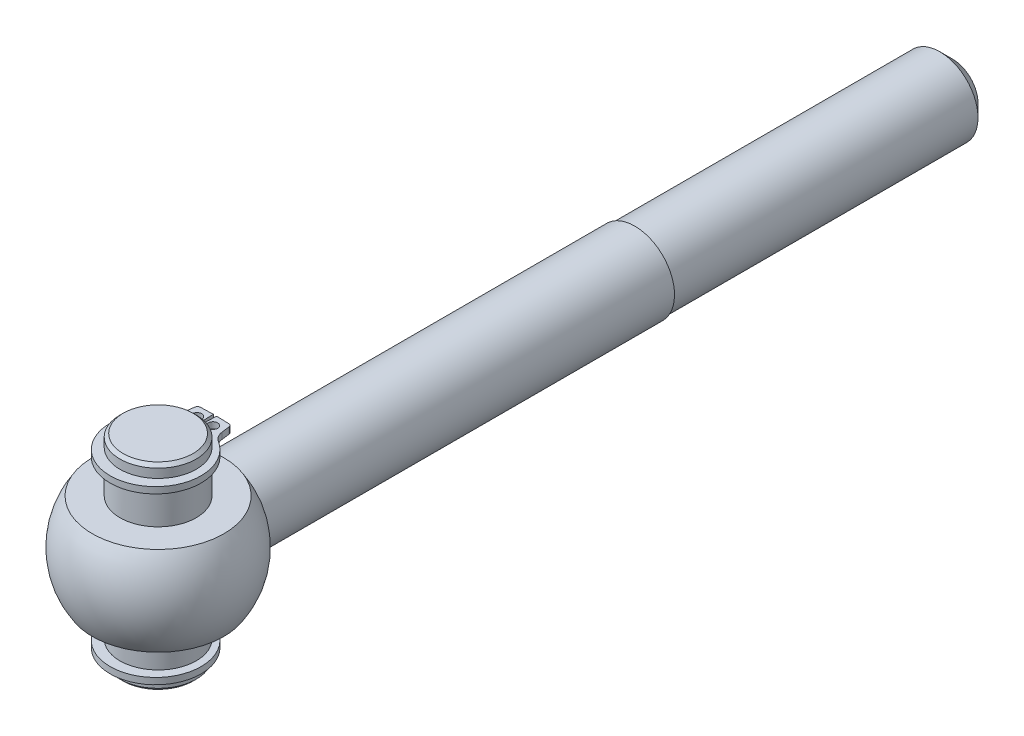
ISO-10303-21;
HEADER;
FILE_DESCRIPTION(('STEP AP214'),'2;1');
FILE_NAME('part.step','',(''),(''),'','','');
FILE_SCHEMA(('AUTOMOTIVE_DESIGN { 1 0 10303 214 1 1 1 1 }'));
ENDSEC;
DATA;
#1=APPLICATION_CONTEXT('core data for automotive mechanical design processes');
#2=APPLICATION_PROTOCOL_DEFINITION('international standard','automotive_design',2000,#1);
#3=PRODUCT_CONTEXT('',#1,'mechanical');
#4=PRODUCT('Part','Part','',(#3));
#5=PRODUCT_RELATED_PRODUCT_CATEGORY('part','',(#4));
#6=PRODUCT_DEFINITION_FORMATION('','',#4);
#7=PRODUCT_DEFINITION_CONTEXT('part definition',#1,'design');
#8=PRODUCT_DEFINITION('design','',#6,#7);
#9=PRODUCT_DEFINITION_SHAPE('','',#8);
#10=(LENGTH_UNIT() NAMED_UNIT(*) SI_UNIT(.MILLI.,.METRE.));
#11=(NAMED_UNIT(*) PLANE_ANGLE_UNIT() SI_UNIT($,.RADIAN.));
#12=(NAMED_UNIT(*) SI_UNIT($,.STERADIAN.) SOLID_ANGLE_UNIT());
#13=UNCERTAINTY_MEASURE_WITH_UNIT(LENGTH_MEASURE(1.E-05),#10,'distance_accuracy_value','');
#14=(GEOMETRIC_REPRESENTATION_CONTEXT(3) GLOBAL_UNCERTAINTY_ASSIGNED_CONTEXT((#13)) GLOBAL_UNIT_ASSIGNED_CONTEXT((#10,
#11,#12)) REPRESENTATION_CONTEXT('',''));
#15=CARTESIAN_POINT('',(0.,0.,0.));
#16=DIRECTION('',(0.,0.,1.));
#17=DIRECTION('',(1.,0.,0.));
#18=AXIS2_PLACEMENT_3D('',#15,#16,#17);
#19=CARTESIAN_POINT('',(-6.77014300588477E-13,13.4999999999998,125.));
#20=DIRECTION('',(0.,-1.,0.));
#21=DIRECTION('',(1.,0.,0.));
#22=AXIS2_PLACEMENT_3D('',#19,#20,#21);
#23=PLANE('',#22);
#24=CARTESIAN_POINT('',(-1.25000000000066,13.4999999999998,117.630256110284));
#25=DIRECTION('',(0.,-1.,0.));
#26=DIRECTION('',(1.,0.,0.));
#27=AXIS2_PLACEMENT_3D('',#24,#25,#26);
#28=CIRCLE('',#27,0.75);
#29=CARTESIAN_POINT('',(-0.500000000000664,13.4999999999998,117.630256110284));
#30=VERTEX_POINT('',#29);
#31=EDGE_CURVE('E644',#30,#30,#28,.T.);
#32=ORIENTED_EDGE('',*,*,#31,.T.);
#33=EDGE_LOOP('',(#32));
#34=FACE_BOUND('',#33,.T.);
#35=CARTESIAN_POINT('',(1.24999999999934,13.4999999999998,117.630256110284));
#36=DIRECTION('',(0.,-1.,0.));
#37=DIRECTION('',(1.,0.,0.));
#38=AXIS2_PLACEMENT_3D('',#35,#36,#37);
#39=CIRCLE('',#38,0.75);
#40=CARTESIAN_POINT('',(1.99999999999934,13.4999999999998,117.630256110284));
#41=VERTEX_POINT('',#40);
#42=EDGE_CURVE('E652',#41,#41,#39,.T.);
#43=ORIENTED_EDGE('',*,*,#42,.T.);
#44=EDGE_LOOP('',(#43));
#45=FACE_BOUND('',#44,.T.);
#46=CARTESIAN_POINT('',(-6.77014300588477E-13,13.4999999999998,125.));
#47=DIRECTION('',(0.,1.,0.));
#48=DIRECTION('',(1.,0.,0.));
#49=AXIS2_PLACEMENT_3D('',#46,#47,#48);
#50=CIRCLE('',#49,5.75);
#51=CARTESIAN_POINT('',(-0.160614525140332,13.4999999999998,119.252243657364));
#52=VERTEX_POINT('',#51);
#53=CARTESIAN_POINT('',(0.160614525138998,13.4999999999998,119.252243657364));
#54=VERTEX_POINT('',#53);
#55=EDGE_CURVE('E205',#52,#54,#50,.T.);
#56=ORIENTED_EDGE('',*,*,#55,.F.);
#57=DIRECTION('',(0.0279329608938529,0.,0.999609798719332));
#58=VECTOR('',#57,1.);
#59=CARTESIAN_POINT('',(-0.160614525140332,13.4999999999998,119.252243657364));
#60=LINE('',#59,#58);
#61=CARTESIAN_POINT('',(-0.250000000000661,13.4999999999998,116.053492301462));
#62=VERTEX_POINT('',#61);
#63=EDGE_CURVE('E207',#62,#52,#60,.T.);
#64=ORIENTED_EDGE('',*,*,#63,.F.);
#65=DIRECTION('',(0.999609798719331,0.,-0.0279329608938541));
#66=VECTOR('',#65,1.);
#67=CARTESIAN_POINT('',(-0.250000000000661,13.4999999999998,116.053492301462));
#68=LINE('',#67,#66);
#69=CARTESIAN_POINT('',(-2.21257169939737,13.4999999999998,116.108334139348));
#70=VERTEX_POINT('',#69);
#71=EDGE_CURVE('E218',#70,#62,#68,.T.);
#72=ORIENTED_EDGE('',*,*,#71,.F.);
#73=CARTESIAN_POINT('',(-2.19860521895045,13.4999999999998,116.608139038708));
#74=DIRECTION('',(0.,-1.,0.));
#75=DIRECTION('',(1.,0.,0.));
#76=AXIS2_PLACEMENT_3D('',#73,#74,#75);
#77=CIRCLE('',#76,0.5);
#78=CARTESIAN_POINT('',(-2.69432764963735,13.4999999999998,116.542875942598));
#79=VERTEX_POINT('',#78);
#80=EDGE_CURVE('E222',#79,#70,#77,.T.);
#81=ORIENTED_EDGE('',*,*,#80,.F.);
#82=DIRECTION('',(0.130526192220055,0.,-0.99144486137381));
#83=VECTOR('',#82,1.);
#84=CARTESIAN_POINT('',(-2.86377907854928,13.4999999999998,117.829987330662));
#85=LINE('',#84,#83);
#86=CARTESIAN_POINT('',(-2.86377907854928,13.4999999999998,117.829987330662));
#87=VERTEX_POINT('',#86);
#88=EDGE_CURVE('E676',#87,#79,#85,.T.);
#89=ORIENTED_EDGE('',*,*,#88,.F.);
#90=CARTESIAN_POINT('',(-4.96489683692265,13.4999999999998,117.553369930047));
#91=DIRECTION('',(0.,1.,0.));
#92=DIRECTION('',(1.,0.,0.));
#93=AXIS2_PLACEMENT_3D('',#90,#91,#92);
#94=CIRCLE('',#93,2.11924822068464);
#95=CARTESIAN_POINT('',(-3.83083698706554,13.4999999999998,119.343655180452));
#96=VERTEX_POINT('',#95);
#97=EDGE_CURVE('E673',#96,#87,#94,.T.);
#98=ORIENTED_EDGE('',*,*,#97,.F.);
#99=CARTESIAN_POINT('',(-6.77713708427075E-13,13.4999999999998,125.391211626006));
#100=DIRECTION('',(0.,-1.,0.));
#101=DIRECTION('',(1.,0.,0.));
#102=AXIS2_PLACEMENT_3D('',#99,#100,#101);
#103=CIRCLE('',#102,7.15878837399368);
#104=CARTESIAN_POINT('',(3.83083698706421,13.4999999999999,119.343655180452));
#105=VERTEX_POINT('',#104);
#106=EDGE_CURVE('E670',#105,#96,#103,.T.);
#107=ORIENTED_EDGE('',*,*,#106,.F.);
#108=CARTESIAN_POINT('',(4.96489683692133,13.4999999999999,117.553369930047));
#109=DIRECTION('',(0.,1.,0.));
#110=DIRECTION('',(1.,0.,0.));
#111=AXIS2_PLACEMENT_3D('',#108,#109,#110);
#112=CIRCLE('',#111,2.11924822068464);
#113=CARTESIAN_POINT('',(2.86377907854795,13.4999999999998,117.829987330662));
#114=VERTEX_POINT('',#113);
#115=EDGE_CURVE('E667',#114,#105,#112,.T.);
#116=ORIENTED_EDGE('',*,*,#115,.F.);
#117=DIRECTION('',(0.130526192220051,0.,0.99144486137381));
#118=VECTOR('',#117,1.);
#119=CARTESIAN_POINT('',(2.86377907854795,13.4999999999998,117.829987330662));
#120=LINE('',#119,#118);
#121=CARTESIAN_POINT('',(2.69432764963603,13.4999999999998,116.542875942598));
#122=VERTEX_POINT('',#121);
#123=EDGE_CURVE('E664',#122,#114,#120,.T.);
#124=ORIENTED_EDGE('',*,*,#123,.F.);
#125=CARTESIAN_POINT('',(2.19860521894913,13.4999999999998,116.608139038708));
#126=DIRECTION('',(0.,-1.,0.));
#127=DIRECTION('',(-1.,0.,0.));
#128=AXIS2_PLACEMENT_3D('',#125,#126,#127);
#129=CIRCLE('',#128,0.5);
#130=CARTESIAN_POINT('',(2.21257169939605,13.4999999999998,116.108334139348));
#131=VERTEX_POINT('',#130);
#132=EDGE_CURVE('E661',#131,#122,#129,.T.);
#133=ORIENTED_EDGE('',*,*,#132,.F.);
#134=DIRECTION('',(0.999609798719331,0.,0.0279329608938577));
#135=VECTOR('',#134,1.);
#136=CARTESIAN_POINT('',(0.249999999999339,13.4999999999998,116.053492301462));
#137=LINE('',#136,#135);
#138=CARTESIAN_POINT('',(0.249999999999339,13.4999999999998,116.053492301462));
#139=VERTEX_POINT('',#138);
#140=EDGE_CURVE('E658',#139,#131,#137,.T.);
#141=ORIENTED_EDGE('',*,*,#140,.F.);
#142=DIRECTION('',(0.0279329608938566,0.,-0.999609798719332));
#143=VECTOR('',#142,1.);
#144=CARTESIAN_POINT('',(0.160614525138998,13.4999999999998,119.252243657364));
#145=LINE('',#144,#143);
#146=EDGE_CURVE('E209',#54,#139,#145,.T.);
#147=ORIENTED_EDGE('',*,*,#146,.F.);
#148=EDGE_LOOP('',(#56,#64,#72,#81,#89,#98,#107,#116,#124,#133,#141,#147));
#149=FACE_BOUND('',#148,.T.);
#150=ADVANCED_FACE('F14',(#34,#45,#149),#23,.F.);
#151=CARTESIAN_POINT('',(1.24999999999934,13.4999999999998,117.630256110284));
#152=DIRECTION('',(0.,-1.,0.));
#153=DIRECTION('',(1.,0.,0.));
#154=AXIS2_PLACEMENT_3D('',#151,#152,#153);
#155=CYLINDRICAL_SURFACE('',#154,0.75);
#156=ORIENTED_EDGE('',*,*,#42,.F.);
#157=EDGE_LOOP('',(#156));
#158=FACE_BOUND('',#157,.T.);
#159=CARTESIAN_POINT('',(1.24999999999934,12.4999999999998,117.630256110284));
#160=DIRECTION('',(0.,-1.,0.));
#161=DIRECTION('',(1.,0.,0.));
#162=AXIS2_PLACEMENT_3D('',#159,#160,#161);
#163=CIRCLE('',#162,0.75);
#164=CARTESIAN_POINT('',(1.99999999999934,12.4999999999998,117.630256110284));
#165=VERTEX_POINT('',#164);
#166=EDGE_CURVE('E649',#165,#165,#163,.T.);
#167=ORIENTED_EDGE('',*,*,#166,.T.);
#168=EDGE_LOOP('',(#167));
#169=FACE_BOUND('',#168,.T.);
#170=ADVANCED_FACE('F631',(#158,#169),#155,.F.);
#171=CARTESIAN_POINT('',(-1.25000000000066,13.4999999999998,117.630256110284));
#172=DIRECTION('',(0.,-1.,0.));
#173=DIRECTION('',(1.,0.,0.));
#174=AXIS2_PLACEMENT_3D('',#171,#172,#173);
#175=CYLINDRICAL_SURFACE('',#174,0.75);
#176=ORIENTED_EDGE('',*,*,#31,.F.);
#177=EDGE_LOOP('',(#176));
#178=FACE_BOUND('',#177,.T.);
#179=CARTESIAN_POINT('',(-1.25000000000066,12.4999999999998,117.630256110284));
#180=DIRECTION('',(0.,-1.,0.));
#181=DIRECTION('',(1.,0.,0.));
#182=AXIS2_PLACEMENT_3D('',#179,#180,#181);
#183=CIRCLE('',#182,0.75);
#184=CARTESIAN_POINT('',(-0.500000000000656,12.4999999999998,117.630256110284));
#185=VERTEX_POINT('',#184);
#186=EDGE_CURVE('E384',#185,#185,#183,.T.);
#187=ORIENTED_EDGE('',*,*,#186,.T.);
#188=EDGE_LOOP('',(#187));
#189=FACE_BOUND('',#188,.T.);
#190=ADVANCED_FACE('F625',(#178,#189),#175,.F.);
#191=CARTESIAN_POINT('',(-0.160614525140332,13.4999999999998,119.252243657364));
#192=DIRECTION('',(0.999609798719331,0.,-0.0279329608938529));
#193=DIRECTION('',(0.0279329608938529,0.,0.999609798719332));
#194=AXIS2_PLACEMENT_3D('',#191,#192,#193);
#195=PLANE('',#194);
#196=DIRECTION('',(0.0279329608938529,0.,0.999609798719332));
#197=VECTOR('',#196,1.);
#198=CARTESIAN_POINT('',(-0.160614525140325,12.4999999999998,119.252243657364));
#199=LINE('',#198,#197);
#200=CARTESIAN_POINT('',(-0.250000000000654,12.4999999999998,116.053492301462));
#201=VERTEX_POINT('',#200);
#202=CARTESIAN_POINT('',(-0.167597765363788,12.4999999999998,119.002341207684));
#203=VERTEX_POINT('',#202);
#204=EDGE_CURVE('E210',#201,#203,#199,.T.);
#205=ORIENTED_EDGE('',*,*,#204,.F.);
#206=DIRECTION('',(0.,-1.,0.));
#207=VECTOR('',#206,1.);
#208=CARTESIAN_POINT('',(-0.250000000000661,13.4999999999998,116.053492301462));
#209=LINE('',#208,#207);
#210=EDGE_CURVE('E199',#62,#201,#209,.T.);
#211=ORIENTED_EDGE('',*,*,#210,.F.);
#212=ORIENTED_EDGE('',*,*,#63,.T.);
#213=DIRECTION('',(0.,-1.,0.));
#214=VECTOR('',#213,1.);
#215=CARTESIAN_POINT('',(-0.160614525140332,13.4999999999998,119.252243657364));
#216=LINE('',#215,#214);
#217=CARTESIAN_POINT('',(-0.160614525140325,12.4999999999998,119.252243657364));
#218=VERTEX_POINT('',#217);
#219=EDGE_CURVE('E24',#52,#218,#216,.T.);
#220=ORIENTED_EDGE('',*,*,#219,.T.);
#221=EDGE_CURVE('E33',#203,#218,#199,.T.);
#222=ORIENTED_EDGE('',*,*,#221,.F.);
#223=EDGE_LOOP('',(#205,#211,#212,#220,#222));
#224=FACE_BOUND('',#223,.T.);
#225=ADVANCED_FACE('F217',(#224),#195,.T.);
#226=CARTESIAN_POINT('',(-0.250000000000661,13.4999999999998,116.053492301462));
#227=DIRECTION('',(-0.0279329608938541,0.,-0.999609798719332));
#228=DIRECTION('',(0.999609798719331,0.,-0.0279329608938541));
#229=AXIS2_PLACEMENT_3D('',#226,#227,#228);
#230=PLANE('',#229);
#231=DIRECTION('',(0.999609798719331,0.,-0.0279329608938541));
#232=VECTOR('',#231,1.);
#233=CARTESIAN_POINT('',(-0.250000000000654,12.4999999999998,116.053492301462));
#234=LINE('',#233,#232);
#235=CARTESIAN_POINT('',(-2.21257169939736,12.4999999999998,116.108334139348));
#236=VERTEX_POINT('',#235);
#237=EDGE_CURVE('E254',#236,#201,#234,.T.);
#238=ORIENTED_EDGE('',*,*,#237,.F.);
#239=DIRECTION('',(0.,-1.,0.));
#240=VECTOR('',#239,1.);
#241=CARTESIAN_POINT('',(-2.21257169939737,13.4999999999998,116.108334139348));
#242=LINE('',#241,#240);
#243=EDGE_CURVE('E260',#70,#236,#242,.T.);
#244=ORIENTED_EDGE('',*,*,#243,.F.);
#245=ORIENTED_EDGE('',*,*,#71,.T.);
#246=ORIENTED_EDGE('',*,*,#210,.T.);
#247=EDGE_LOOP('',(#238,#244,#245,#246));
#248=FACE_BOUND('',#247,.T.);
#249=ADVANCED_FACE('F618',(#248),#230,.T.);
#250=CARTESIAN_POINT('',(-2.19860521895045,13.4999999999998,116.608139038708));
#251=DIRECTION('',(0.,-1.,0.));
#252=DIRECTION('',(1.,0.,0.));
#253=AXIS2_PLACEMENT_3D('',#250,#251,#252);
#254=CYLINDRICAL_SURFACE('',#253,0.5);
#255=CARTESIAN_POINT('',(-2.19860521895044,12.4999999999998,116.608139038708));
#256=DIRECTION('',(0.,-1.,0.));
#257=DIRECTION('',(1.,0.,0.));
#258=AXIS2_PLACEMENT_3D('',#255,#256,#257);
#259=CIRCLE('',#258,0.5);
#260=CARTESIAN_POINT('',(-2.69432764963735,12.4999999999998,116.542875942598));
#261=VERTEX_POINT('',#260);
#262=EDGE_CURVE('E251',#261,#236,#259,.T.);
#263=ORIENTED_EDGE('',*,*,#262,.F.);
#264=DIRECTION('',(0.,-1.,0.));
#265=VECTOR('',#264,1.);
#266=CARTESIAN_POINT('',(-2.69432764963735,13.4999999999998,116.542875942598));
#267=LINE('',#266,#265);
#268=EDGE_CURVE('E262',#79,#261,#267,.T.);
#269=ORIENTED_EDGE('',*,*,#268,.F.);
#270=ORIENTED_EDGE('',*,*,#80,.T.);
#271=ORIENTED_EDGE('',*,*,#243,.T.);
#272=EDGE_LOOP('',(#263,#269,#270,#271));
#273=FACE_BOUND('',#272,.T.);
#274=ADVANCED_FACE('F614',(#273),#254,.T.);
#275=CARTESIAN_POINT('',(-2.86377907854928,13.4999999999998,117.829987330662));
#276=DIRECTION('',(-0.99144486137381,0.,-0.130526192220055));
#277=DIRECTION('',(0.130526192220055,0.,-0.99144486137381));
#278=AXIS2_PLACEMENT_3D('',#275,#276,#277);
#279=PLANE('',#278);
#280=DIRECTION('',(0.130526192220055,0.,-0.99144486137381));
#281=VECTOR('',#280,1.);
#282=CARTESIAN_POINT('',(-2.86377907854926,12.4999999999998,117.829987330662));
#283=LINE('',#282,#281);
#284=CARTESIAN_POINT('',(-2.86377907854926,12.4999999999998,117.829987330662));
#285=VERTEX_POINT('',#284);
#286=EDGE_CURVE('E248',#285,#261,#283,.T.);
#287=ORIENTED_EDGE('',*,*,#286,.F.);
#288=DIRECTION('',(0.,-1.,0.));
#289=VECTOR('',#288,1.);
#290=CARTESIAN_POINT('',(-2.86377907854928,13.4999999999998,117.829987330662));
#291=LINE('',#290,#289);
#292=EDGE_CURVE('E264',#87,#285,#291,.T.);
#293=ORIENTED_EDGE('',*,*,#292,.F.);
#294=ORIENTED_EDGE('',*,*,#88,.T.);
#295=ORIENTED_EDGE('',*,*,#268,.T.);
#296=EDGE_LOOP('',(#287,#293,#294,#295));
#297=FACE_BOUND('',#296,.T.);
#298=ADVANCED_FACE('F610',(#297),#279,.T.);
#299=CARTESIAN_POINT('',(-4.96489683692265,13.4999999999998,117.553369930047));
#300=DIRECTION('',(0.,-1.,0.));
#301=DIRECTION('',(1.,0.,0.));
#302=AXIS2_PLACEMENT_3D('',#299,#300,#301);
#303=CYLINDRICAL_SURFACE('',#302,2.11924822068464);
#304=CARTESIAN_POINT('',(-4.96489683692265,12.4999999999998,117.553369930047));
#305=DIRECTION('',(0.,1.,0.));
#306=DIRECTION('',(1.,0.,0.));
#307=AXIS2_PLACEMENT_3D('',#304,#305,#306);
#308=CIRCLE('',#307,2.11924822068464);
#309=CARTESIAN_POINT('',(-3.83083698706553,12.4999999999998,119.343655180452));
#310=VERTEX_POINT('',#309);
#311=EDGE_CURVE('E245',#310,#285,#308,.T.);
#312=ORIENTED_EDGE('',*,*,#311,.F.);
#313=DIRECTION('',(0.,-1.,0.));
#314=VECTOR('',#313,1.);
#315=CARTESIAN_POINT('',(-3.83083698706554,13.4999999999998,119.343655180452));
#316=LINE('',#315,#314);
#317=EDGE_CURVE('E266',#96,#310,#316,.T.);
#318=ORIENTED_EDGE('',*,*,#317,.F.);
#319=ORIENTED_EDGE('',*,*,#97,.T.);
#320=ORIENTED_EDGE('',*,*,#292,.T.);
#321=EDGE_LOOP('',(#312,#318,#319,#320));
#322=FACE_BOUND('',#321,.T.);
#323=ADVANCED_FACE('F606',(#322),#303,.F.);
#324=CARTESIAN_POINT('',(-6.77713708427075E-13,13.4999999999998,125.391211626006));
#325=DIRECTION('',(0.,-1.,0.));
#326=DIRECTION('',(1.,0.,0.));
#327=AXIS2_PLACEMENT_3D('',#324,#325,#326);
#328=CYLINDRICAL_SURFACE('',#327,7.15878837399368);
#329=CARTESIAN_POINT('',(-6.70730741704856E-13,12.4999999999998,125.391211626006));
#330=DIRECTION('',(0.,-1.,0.));
#331=DIRECTION('',(1.,0.,0.));
#332=AXIS2_PLACEMENT_3D('',#329,#330,#331);
#333=CIRCLE('',#332,7.15878837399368);
#334=CARTESIAN_POINT('',(3.83083698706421,12.4999999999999,119.343655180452));
#335=VERTEX_POINT('',#334);
#336=EDGE_CURVE('E242',#335,#310,#333,.T.);
#337=ORIENTED_EDGE('',*,*,#336,.F.);
#338=DIRECTION('',(0.,-1.,0.));
#339=VECTOR('',#338,1.);
#340=CARTESIAN_POINT('',(3.83083698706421,13.4999999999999,119.343655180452));
#341=LINE('',#340,#339);
#342=EDGE_CURVE('E268',#105,#335,#341,.T.);
#343=ORIENTED_EDGE('',*,*,#342,.F.);
#344=ORIENTED_EDGE('',*,*,#106,.T.);
#345=ORIENTED_EDGE('',*,*,#317,.T.);
#346=EDGE_LOOP('',(#337,#343,#344,#345));
#347=FACE_BOUND('',#346,.T.);
#348=ADVANCED_FACE('F602',(#347),#328,.T.);
#349=CARTESIAN_POINT('',(4.96489683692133,13.4999999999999,117.553369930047));
#350=DIRECTION('',(0.,-1.,0.));
#351=DIRECTION('',(1.,0.,0.));
#352=AXIS2_PLACEMENT_3D('',#349,#350,#351);
#353=CYLINDRICAL_SURFACE('',#352,2.11924822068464);
#354=CARTESIAN_POINT('',(4.96489683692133,12.4999999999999,117.553369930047));
#355=DIRECTION('',(0.,1.,0.));
#356=DIRECTION('',(1.,0.,0.));
#357=AXIS2_PLACEMENT_3D('',#354,#355,#356);
#358=CIRCLE('',#357,2.11924822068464);
#359=CARTESIAN_POINT('',(2.86377907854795,12.4999999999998,117.829987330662));
#360=VERTEX_POINT('',#359);
#361=EDGE_CURVE('E239',#360,#335,#358,.T.);
#362=ORIENTED_EDGE('',*,*,#361,.F.);
#363=DIRECTION('',(0.,-1.,0.));
#364=VECTOR('',#363,1.);
#365=CARTESIAN_POINT('',(2.86377907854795,13.4999999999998,117.829987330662));
#366=LINE('',#365,#364);
#367=EDGE_CURVE('E270',#114,#360,#366,.T.);
#368=ORIENTED_EDGE('',*,*,#367,.F.);
#369=ORIENTED_EDGE('',*,*,#115,.T.);
#370=ORIENTED_EDGE('',*,*,#342,.T.);
#371=EDGE_LOOP('',(#362,#368,#369,#370));
#372=FACE_BOUND('',#371,.T.);
#373=ADVANCED_FACE('F598',(#372),#353,.F.);
#374=CARTESIAN_POINT('',(2.86377907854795,13.4999999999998,117.829987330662));
#375=DIRECTION('',(0.99144486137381,0.,-0.130526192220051));
#376=DIRECTION('',(0.130526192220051,0.,0.99144486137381));
#377=AXIS2_PLACEMENT_3D('',#374,#375,#376);
#378=PLANE('',#377);
#379=DIRECTION('',(0.130526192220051,0.,0.99144486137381));
#380=VECTOR('',#379,1.);
#381=CARTESIAN_POINT('',(2.86377907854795,12.4999999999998,117.829987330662));
#382=LINE('',#381,#380);
#383=CARTESIAN_POINT('',(2.69432764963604,12.4999999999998,116.542875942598));
#384=VERTEX_POINT('',#383);
#385=EDGE_CURVE('E236',#384,#360,#382,.T.);
#386=ORIENTED_EDGE('',*,*,#385,.F.);
#387=DIRECTION('',(0.,-1.,0.));
#388=VECTOR('',#387,1.);
#389=CARTESIAN_POINT('',(2.69432764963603,13.4999999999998,116.542875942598));
#390=LINE('',#389,#388);
#391=EDGE_CURVE('E272',#122,#384,#390,.T.);
#392=ORIENTED_EDGE('',*,*,#391,.F.);
#393=ORIENTED_EDGE('',*,*,#123,.T.);
#394=ORIENTED_EDGE('',*,*,#367,.T.);
#395=EDGE_LOOP('',(#386,#392,#393,#394));
#396=FACE_BOUND('',#395,.T.);
#397=ADVANCED_FACE('F594',(#396),#378,.T.);
#398=CARTESIAN_POINT('',(2.19860521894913,13.4999999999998,116.608139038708));
#399=DIRECTION('',(0.,-1.,0.));
#400=DIRECTION('',(1.,0.,0.));
#401=AXIS2_PLACEMENT_3D('',#398,#399,#400);
#402=CYLINDRICAL_SURFACE('',#401,0.5);
#403=CARTESIAN_POINT('',(2.19860521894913,12.4999999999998,116.608139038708));
#404=DIRECTION('',(0.,-1.,0.));
#405=DIRECTION('',(-1.,0.,0.));
#406=AXIS2_PLACEMENT_3D('',#403,#404,#405);
#407=CIRCLE('',#406,0.5);
#408=CARTESIAN_POINT('',(2.21257169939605,12.4999999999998,116.108334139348));
#409=VERTEX_POINT('',#408);
#410=EDGE_CURVE('E233',#409,#384,#407,.T.);
#411=ORIENTED_EDGE('',*,*,#410,.F.);
#412=DIRECTION('',(0.,-1.,0.));
#413=VECTOR('',#412,1.);
#414=CARTESIAN_POINT('',(2.21257169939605,13.4999999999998,116.108334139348));
#415=LINE('',#414,#413);
#416=EDGE_CURVE('E274',#131,#409,#415,.T.);
#417=ORIENTED_EDGE('',*,*,#416,.F.);
#418=ORIENTED_EDGE('',*,*,#132,.T.);
#419=ORIENTED_EDGE('',*,*,#391,.T.);
#420=EDGE_LOOP('',(#411,#417,#418,#419));
#421=FACE_BOUND('',#420,.T.);
#422=ADVANCED_FACE('F590',(#421),#402,.T.);
#423=CARTESIAN_POINT('',(0.249999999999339,13.4999999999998,116.053492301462));
#424=DIRECTION('',(0.0279329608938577,0.,-0.999609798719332));
#425=DIRECTION('',(0.999609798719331,0.,0.0279329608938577));
#426=AXIS2_PLACEMENT_3D('',#423,#424,#425);
#427=PLANE('',#426);
#428=DIRECTION('',(0.999609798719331,0.,0.0279329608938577));
#429=VECTOR('',#428,1.);
#430=CARTESIAN_POINT('',(0.249999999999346,12.4999999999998,116.053492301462));
#431=LINE('',#430,#429);
#432=CARTESIAN_POINT('',(0.249999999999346,12.4999999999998,116.053492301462));
#433=VERTEX_POINT('',#432);
#434=EDGE_CURVE('E229',#433,#409,#431,.T.);
#435=ORIENTED_EDGE('',*,*,#434,.F.);
#436=DIRECTION('',(0.,-1.,0.));
#437=VECTOR('',#436,1.);
#438=CARTESIAN_POINT('',(0.249999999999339,13.4999999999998,116.053492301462));
#439=LINE('',#438,#437);
#440=EDGE_CURVE('E220',#139,#433,#439,.T.);
#441=ORIENTED_EDGE('',*,*,#440,.F.);
#442=ORIENTED_EDGE('',*,*,#140,.T.);
#443=ORIENTED_EDGE('',*,*,#416,.T.);
#444=EDGE_LOOP('',(#435,#441,#442,#443));
#445=FACE_BOUND('',#444,.T.);
#446=ADVANCED_FACE('F587',(#445),#427,.T.);
#447=CARTESIAN_POINT('',(0.160614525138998,13.4999999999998,119.252243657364));
#448=DIRECTION('',(-0.999609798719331,0.,-0.0279329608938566));
#449=DIRECTION('',(0.0279329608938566,0.,-0.999609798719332));
#450=AXIS2_PLACEMENT_3D('',#447,#448,#449);
#451=PLANE('',#450);
#452=DIRECTION('',(0.0279329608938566,0.,-0.999609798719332));
#453=VECTOR('',#452,1.);
#454=CARTESIAN_POINT('',(0.160614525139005,12.4999999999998,119.252243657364));
#455=LINE('',#454,#453);
#456=CARTESIAN_POINT('',(0.160614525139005,12.4999999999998,119.252243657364));
#457=VERTEX_POINT('',#456);
#458=CARTESIAN_POINT('',(0.16759776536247,12.4999999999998,119.002341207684));
#459=VERTEX_POINT('',#458);
#460=EDGE_CURVE('E226',#457,#459,#455,.T.);
#461=ORIENTED_EDGE('',*,*,#460,.F.);
#462=DIRECTION('',(0.,-1.,0.));
#463=VECTOR('',#462,1.);
#464=CARTESIAN_POINT('',(0.160614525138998,13.4999999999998,119.252243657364));
#465=LINE('',#464,#463);
#466=EDGE_CURVE('E130',#54,#457,#465,.T.);
#467=ORIENTED_EDGE('',*,*,#466,.F.);
#468=ORIENTED_EDGE('',*,*,#146,.T.);
#469=ORIENTED_EDGE('',*,*,#440,.T.);
#470=EDGE_CURVE('E230',#459,#433,#455,.T.);
#471=ORIENTED_EDGE('',*,*,#470,.F.);
#472=EDGE_LOOP('',(#461,#467,#468,#469,#471));
#473=FACE_BOUND('',#472,.T.);
#474=ADVANCED_FACE('F584',(#473),#451,.T.);
#475=CARTESIAN_POINT('',(-6.70031333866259E-13,12.4999999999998,125.));
#476=DIRECTION('',(0.,-1.,0.));
#477=DIRECTION('',(1.,0.,0.));
#478=AXIS2_PLACEMENT_3D('',#475,#476,#477);
#479=PLANE('',#478);
#480=CARTESIAN_POINT('',(0.,12.4999999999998,125.));
#481=DIRECTION('',(0.,-1.,0.));
#482=DIRECTION('',(-1.,0.,0.));
#483=AXIS2_PLACEMENT_3D('',#480,#481,#482);
#484=CIRCLE('',#483,6.);
#485=EDGE_CURVE('E9',#459,#203,#484,.T.);
#486=ORIENTED_EDGE('',*,*,#485,.F.);
#487=ORIENTED_EDGE('',*,*,#470,.T.);
#488=ORIENTED_EDGE('',*,*,#434,.T.);
#489=ORIENTED_EDGE('',*,*,#410,.T.);
#490=ORIENTED_EDGE('',*,*,#385,.T.);
#491=ORIENTED_EDGE('',*,*,#361,.T.);
#492=ORIENTED_EDGE('',*,*,#336,.T.);
#493=ORIENTED_EDGE('',*,*,#311,.T.);
#494=ORIENTED_EDGE('',*,*,#286,.T.);
#495=ORIENTED_EDGE('',*,*,#262,.T.);
#496=ORIENTED_EDGE('',*,*,#237,.T.);
#497=ORIENTED_EDGE('',*,*,#204,.T.);
#498=EDGE_LOOP('',(#486,#487,#488,#489,#490,#491,#492,#493,#494,#495,#496,#497));
#499=FACE_BOUND('',#498,.T.);
#500=ORIENTED_EDGE('',*,*,#186,.F.);
#501=EDGE_LOOP('',(#500));
#502=FACE_BOUND('',#501,.T.);
#503=ORIENTED_EDGE('',*,*,#166,.F.);
#504=EDGE_LOOP('',(#503));
#505=FACE_BOUND('',#504,.T.);
#506=ADVANCED_FACE('F517',(#499,#502,#505),#479,.T.);
#507=CARTESIAN_POINT('',(0.,-15.5,125.));
#508=DIRECTION('',(0.,-1.,0.));
#509=DIRECTION('',(0.,0.,-1.));
#510=AXIS2_PLACEMENT_3D('',#507,#508,#509);
#511=PLANE('',#510);
#512=CARTESIAN_POINT('',(0.,-15.5,125.));
#513=DIRECTION('',(0.,-1.,0.));
#514=DIRECTION('',(0.,0.,-1.));
#515=AXIS2_PLACEMENT_3D('',#512,#513,#514);
#516=CIRCLE('',#515,5.5);
#517=CARTESIAN_POINT('',(0.,-15.5,119.5));
#518=VERTEX_POINT('',#517);
#519=EDGE_CURVE('E414',#518,#518,#516,.T.);
#520=ORIENTED_EDGE('',*,*,#519,.T.);
#521=EDGE_LOOP('',(#520));
#522=FACE_BOUND('',#521,.T.);
#523=ADVANCED_FACE('F514',(#522),#511,.T.);
#524=CARTESIAN_POINT('',(0.,-15.5,125.));
#525=DIRECTION('',(0.,1.,0.));
#526=DIRECTION('',(0.,0.,1.));
#527=AXIS2_PLACEMENT_3D('',#524,#525,#526);
#528=CONICAL_SURFACE('',#527,5.5,0.785398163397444);
#529=CARTESIAN_POINT('',(0.,-15.,125.));
#530=DIRECTION('',(0.,-1.,0.));
#531=DIRECTION('',(0.,0.,-1.));
#532=AXIS2_PLACEMENT_3D('',#529,#530,#531);
#533=CIRCLE('',#532,6.);
#534=CARTESIAN_POINT('',(0.,-15.,119.));
#535=VERTEX_POINT('',#534);
#536=EDGE_CURVE('E417',#535,#535,#533,.F.);
#537=ORIENTED_EDGE('',*,*,#536,.F.);
#538=EDGE_LOOP('',(#537));
#539=FACE_BOUND('',#538,.T.);
#540=ORIENTED_EDGE('',*,*,#519,.F.);
#541=EDGE_LOOP('',(#540));
#542=FACE_BOUND('',#541,.T.);
#543=ADVANCED_FACE('F495',(#539,#542),#528,.T.);
#544=CARTESIAN_POINT('',(0.,15.5,125.));
#545=DIRECTION('',(0.,-1.,0.));
#546=DIRECTION('',(0.,0.,-1.));
#547=AXIS2_PLACEMENT_3D('',#544,#545,#546);
#548=CYLINDRICAL_SURFACE('',#547,6.);
#549=ORIENTED_EDGE('',*,*,#536,.T.);
#550=EDGE_LOOP('',(#549));
#551=FACE_BOUND('',#550,.T.);
#552=CARTESIAN_POINT('',(0.,-13.6000000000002,125.));
#553=DIRECTION('',(0.,-1.,0.));
#554=DIRECTION('',(0.,0.,-1.));
#555=AXIS2_PLACEMENT_3D('',#552,#553,#554);
#556=CIRCLE('',#555,6.);
#557=CARTESIAN_POINT('',(0.,-13.6000000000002,119.));
#558=VERTEX_POINT('',#557);
#559=EDGE_CURVE('E403',#558,#558,#556,.T.);
#560=ORIENTED_EDGE('',*,*,#559,.T.);
#561=EDGE_LOOP('',(#560));
#562=FACE_BOUND('',#561,.T.);
#563=ADVANCED_FACE('F485',(#551,#562),#548,.T.);
#564=CARTESIAN_POINT('',(-4.,0.,0.));
#565=DIRECTION('',(0.,0.,-1.));
#566=DIRECTION('',(0.,-1.,0.));
#567=AXIS2_PLACEMENT_3D('',#564,#565,#566);
#568=PLANE('',#567);
#569=CARTESIAN_POINT('',(0.,0.,0.));
#570=DIRECTION('',(0.,0.,1.));
#571=DIRECTION('',(0.,1.,0.));
#572=AXIS2_PLACEMENT_3D('',#569,#570,#571);
#573=CIRCLE('',#572,4.);
#574=CARTESIAN_POINT('',(0.,4.,0.));
#575=VERTEX_POINT('',#574);
#576=EDGE_CURVE('E433',#575,#575,#573,.T.);
#577=ORIENTED_EDGE('',*,*,#576,.F.);
#578=EDGE_LOOP('',(#577));
#579=FACE_BOUND('',#578,.T.);
#580=ADVANCED_FACE('F494',(#579),#568,.T.);
#581=CARTESIAN_POINT('',(0.,-13.6000000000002,125.));
#582=DIRECTION('',(0.,-1.,0.));
#583=DIRECTION('',(0.,0.,-1.));
#584=AXIS2_PLACEMENT_3D('',#581,#582,#583);
#585=PLANE('',#584);
#586=ORIENTED_EDGE('',*,*,#559,.F.);
#587=EDGE_LOOP('',(#586));
#588=FACE_BOUND('',#587,.T.);
#589=CARTESIAN_POINT('',(0.,-13.6000000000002,125.));
#590=DIRECTION('',(0.,-1.,0.));
#591=DIRECTION('',(0.,0.,-1.));
#592=AXIS2_PLACEMENT_3D('',#589,#590,#591);
#593=CIRCLE('',#592,5.75);
#594=CARTESIAN_POINT('',(0.,-13.6000000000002,119.25));
#595=VERTEX_POINT('',#594);
#596=EDGE_CURVE('E397',#595,#595,#593,.T.);
#597=ORIENTED_EDGE('',*,*,#596,.T.);
#598=EDGE_LOOP('',(#597));
#599=FACE_BOUND('',#598,.T.);
#600=ADVANCED_FACE('F497',(#588,#599),#585,.F.);
#601=CARTESIAN_POINT('',(0.,-13.5000000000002,125.));
#602=DIRECTION('',(0.,1.,0.));
#603=DIRECTION('',(-1.,0.,0.));
#604=AXIS2_PLACEMENT_3D('',#601,#602,#603);
#605=PLANE('',#604);
#606=CARTESIAN_POINT('',(1.24999999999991,-13.5000000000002,117.630256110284));
#607=DIRECTION('',(0.,1.,0.));
#608=DIRECTION('',(-1.,0.,0.));
#609=AXIS2_PLACEMENT_3D('',#606,#607,#608);
#610=CIRCLE('',#609,0.75);
#611=CARTESIAN_POINT('',(0.499999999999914,-13.5000000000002,117.630256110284));
#612=VERTEX_POINT('',#611);
#613=EDGE_CURVE('E278',#612,#612,#610,.T.);
#614=ORIENTED_EDGE('',*,*,#613,.T.);
#615=EDGE_LOOP('',(#614));
#616=FACE_BOUND('',#615,.T.);
#617=CARTESIAN_POINT('',(-1.25000000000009,-13.5000000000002,117.630256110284));
#618=DIRECTION('',(0.,1.,0.));
#619=DIRECTION('',(-1.,0.,0.));
#620=AXIS2_PLACEMENT_3D('',#617,#618,#619);
#621=CIRCLE('',#620,0.75);
#622=CARTESIAN_POINT('',(-2.00000000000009,-13.5000000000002,117.630256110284));
#623=VERTEX_POINT('',#622);
#624=EDGE_CURVE('E285',#623,#623,#621,.T.);
#625=ORIENTED_EDGE('',*,*,#624,.T.);
#626=EDGE_LOOP('',(#625));
#627=FACE_BOUND('',#626,.T.);
#628=CARTESIAN_POINT('',(0.,-13.5000000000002,125.));
#629=DIRECTION('',(0.,-1.,0.));
#630=DIRECTION('',(-1.,0.,0.));
#631=AXIS2_PLACEMENT_3D('',#628,#629,#630);
#632=CIRCLE('',#631,5.75);
#633=CARTESIAN_POINT('',(0.160614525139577,-13.5000000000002,119.252243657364));
#634=VERTEX_POINT('',#633);
#635=CARTESIAN_POINT('',(-0.160614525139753,-13.5000000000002,119.252243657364));
#636=VERTEX_POINT('',#635);
#637=EDGE_CURVE('E291',#634,#636,#632,.T.);
#638=ORIENTED_EDGE('',*,*,#637,.F.);
#639=DIRECTION('',(-0.0279329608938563,0.,0.999609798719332));
#640=VECTOR('',#639,1.);
#641=CARTESIAN_POINT('',(0.160614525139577,-13.5000000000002,119.252243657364));
#642=LINE('',#641,#640);
#643=CARTESIAN_POINT('',(0.249999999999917,-13.5000000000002,116.053492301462));
#644=VERTEX_POINT('',#643);
#645=EDGE_CURVE('E325',#644,#634,#642,.T.);
#646=ORIENTED_EDGE('',*,*,#645,.F.);
#647=DIRECTION('',(-0.999609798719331,0.,-0.0279329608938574));
#648=VECTOR('',#647,1.);
#649=CARTESIAN_POINT('',(0.249999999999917,-13.5000000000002,116.053492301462));
#650=LINE('',#649,#648);
#651=CARTESIAN_POINT('',(2.21257169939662,-13.5000000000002,116.108334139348));
#652=VERTEX_POINT('',#651);
#653=EDGE_CURVE('E322',#652,#644,#650,.T.);
#654=ORIENTED_EDGE('',*,*,#653,.F.);
#655=CARTESIAN_POINT('',(2.1986052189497,-13.5000000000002,116.608139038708));
#656=DIRECTION('',(0.,1.,0.));
#657=DIRECTION('',(-1.,0.,0.));
#658=AXIS2_PLACEMENT_3D('',#655,#656,#657);
#659=CIRCLE('',#658,0.5);
#660=CARTESIAN_POINT('',(2.6943276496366,-13.5000000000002,116.542875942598));
#661=VERTEX_POINT('',#660);
#662=EDGE_CURVE('E319',#661,#652,#659,.T.);
#663=ORIENTED_EDGE('',*,*,#662,.F.);
#664=DIRECTION('',(-0.130526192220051,0.,-0.99144486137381));
#665=VECTOR('',#664,1.);
#666=CARTESIAN_POINT('',(2.86377907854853,-13.5000000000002,117.829987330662));
#667=LINE('',#666,#665);
#668=CARTESIAN_POINT('',(2.86377907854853,-13.5000000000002,117.829987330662));
#669=VERTEX_POINT('',#668);
#670=EDGE_CURVE('E316',#669,#661,#667,.T.);
#671=ORIENTED_EDGE('',*,*,#670,.F.);
#672=CARTESIAN_POINT('',(4.9648968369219,-13.5000000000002,117.553369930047));
#673=DIRECTION('',(0.,-1.,0.));
#674=DIRECTION('',(-1.,0.,0.));
#675=AXIS2_PLACEMENT_3D('',#672,#673,#674);
#676=CIRCLE('',#675,2.11924822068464);
#677=CARTESIAN_POINT('',(3.83083698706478,-13.5000000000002,119.343655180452));
#678=VERTEX_POINT('',#677);
#679=EDGE_CURVE('E313',#678,#669,#676,.T.);
#680=ORIENTED_EDGE('',*,*,#679,.F.);
#681=CARTESIAN_POINT('',(0.,-13.5000000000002,125.391211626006));
#682=DIRECTION('',(0.,1.,0.));
#683=DIRECTION('',(-1.,0.,0.));
#684=AXIS2_PLACEMENT_3D('',#681,#682,#683);
#685=CIRCLE('',#684,7.15878837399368);
#686=CARTESIAN_POINT('',(-3.83083698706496,-13.5000000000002,119.343655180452));
#687=VERTEX_POINT('',#686);
#688=EDGE_CURVE('E310',#687,#678,#685,.T.);
#689=ORIENTED_EDGE('',*,*,#688,.F.);
#690=CARTESIAN_POINT('',(-4.96489683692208,-13.5000000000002,117.553369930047));
#691=DIRECTION('',(0.,-1.,0.));
#692=DIRECTION('',(-1.,0.,0.));
#693=AXIS2_PLACEMENT_3D('',#690,#691,#692);
#694=CIRCLE('',#693,2.11924822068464);
#695=CARTESIAN_POINT('',(-2.8637790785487,-13.5000000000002,117.829987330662));
#696=VERTEX_POINT('',#695);
#697=EDGE_CURVE('E307',#696,#687,#694,.T.);
#698=ORIENTED_EDGE('',*,*,#697,.F.);
#699=DIRECTION('',(-0.130526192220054,0.,0.99144486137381));
#700=VECTOR('',#699,1.);
#701=CARTESIAN_POINT('',(-2.8637790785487,-13.5000000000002,117.829987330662));
#702=LINE('',#701,#700);
#703=CARTESIAN_POINT('',(-2.69432764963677,-13.5000000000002,116.542875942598));
#704=VERTEX_POINT('',#703);
#705=EDGE_CURVE('E304',#704,#696,#702,.T.);
#706=ORIENTED_EDGE('',*,*,#705,.F.);
#707=CARTESIAN_POINT('',(-2.19860521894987,-13.5000000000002,116.608139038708));
#708=DIRECTION('',(0.,1.,0.));
#709=DIRECTION('',(1.,0.,0.));
#710=AXIS2_PLACEMENT_3D('',#707,#708,#709);
#711=CIRCLE('',#710,0.5);
#712=CARTESIAN_POINT('',(-2.21257169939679,-13.5000000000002,116.108334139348));
#713=VERTEX_POINT('',#712);
#714=EDGE_CURVE('E301',#713,#704,#711,.T.);
#715=ORIENTED_EDGE('',*,*,#714,.F.);
#716=DIRECTION('',(-0.999609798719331,0.,0.0279329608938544));
#717=VECTOR('',#716,1.);
#718=CARTESIAN_POINT('',(-0.250000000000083,-13.5000000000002,116.053492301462));
#719=LINE('',#718,#717);
#720=CARTESIAN_POINT('',(-0.250000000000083,-13.5000000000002,116.053492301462));
#721=VERTEX_POINT('',#720);
#722=EDGE_CURVE('E298',#721,#713,#719,.T.);
#723=ORIENTED_EDGE('',*,*,#722,.F.);
#724=DIRECTION('',(-0.0279329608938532,0.,-0.999609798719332));
#725=VECTOR('',#724,1.);
#726=CARTESIAN_POINT('',(-0.160614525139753,-13.5000000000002,119.252243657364));
#727=LINE('',#726,#725);
#728=EDGE_CURVE('E294',#636,#721,#727,.T.);
#729=ORIENTED_EDGE('',*,*,#728,.F.);
#730=EDGE_LOOP('',(#638,#646,#654,#663,#671,#680,#689,#698,#706,#715,#723,#729));
#731=FACE_BOUND('',#730,.T.);
#732=ADVANCED_FACE('F503',(#616,#627,#731),#605,.F.);
#733=CARTESIAN_POINT('',(0.,0.,0.));
#734=DIRECTION('',(0.,0.,1.));
#735=DIRECTION('',(0.,1.,0.));
#736=AXIS2_PLACEMENT_3D('',#733,#734,#735);
#737=CONICAL_SURFACE('',#736,4.,0.785398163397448);
#738=CARTESIAN_POINT('',(0.,0.,2.));
#739=DIRECTION('',(0.,0.,1.));
#740=DIRECTION('',(0.,1.,0.));
#741=AXIS2_PLACEMENT_3D('',#738,#739,#740);
#742=CIRCLE('',#741,6.);
#743=CARTESIAN_POINT('',(0.,6.,2.));
#744=VERTEX_POINT('',#743);
#745=EDGE_CURVE('E390',#744,#744,#742,.T.);
#746=ORIENTED_EDGE('',*,*,#745,.F.);
#747=EDGE_LOOP('',(#746));
#748=FACE_BOUND('',#747,.T.);
#749=ORIENTED_EDGE('',*,*,#576,.T.);
#750=EDGE_LOOP('',(#749));
#751=FACE_BOUND('',#750,.T.);
#752=ADVANCED_FACE('F529',(#748,#751),#737,.T.);
#753=CARTESIAN_POINT('',(0.,-13.6000000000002,125.));
#754=DIRECTION('',(0.,1.,0.));
#755=DIRECTION('',(0.,0.,1.));
#756=AXIS2_PLACEMENT_3D('',#753,#754,#755);
#757=CYLINDRICAL_SURFACE('',#756,5.75);
#758=DIRECTION('',(0.,1.,0.));
#759=VECTOR('',#758,1.);
#760=CARTESIAN_POINT('',(0.160614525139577,-13.5000000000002,119.252243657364));
#761=LINE('',#760,#759);
#762=CARTESIAN_POINT('',(0.160614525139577,-12.5000000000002,119.252243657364));
#763=VERTEX_POINT('',#762);
#764=EDGE_CURVE('E359',#634,#763,#761,.T.);
#765=ORIENTED_EDGE('',*,*,#764,.F.);
#766=ORIENTED_EDGE('',*,*,#637,.T.);
#767=DIRECTION('',(0.,1.,0.));
#768=VECTOR('',#767,1.);
#769=CARTESIAN_POINT('',(-0.160614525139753,-13.5000000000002,119.252243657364));
#770=LINE('',#769,#768);
#771=CARTESIAN_POINT('',(-0.160614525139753,-12.5000000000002,119.252243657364));
#772=VERTEX_POINT('',#771);
#773=EDGE_CURVE('E328',#636,#772,#770,.T.);
#774=ORIENTED_EDGE('',*,*,#773,.T.);
#775=CARTESIAN_POINT('',(0.,-12.5000000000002,125.));
#776=DIRECTION('',(0.,-1.,0.));
#777=DIRECTION('',(0.,0.,-1.));
#778=AXIS2_PLACEMENT_3D('',#775,#776,#777);
#779=CIRCLE('',#778,5.75);
#780=EDGE_CURVE('E394',#772,#763,#779,.T.);
#781=ORIENTED_EDGE('',*,*,#780,.T.);
#782=EDGE_LOOP('',(#765,#766,#774,#781));
#783=FACE_BOUND('',#782,.T.);
#784=ORIENTED_EDGE('',*,*,#596,.F.);
#785=EDGE_LOOP('',(#784));
#786=FACE_BOUND('',#785,.T.);
#787=ADVANCED_FACE('F523',(#783,#786),#757,.T.);
#788=CARTESIAN_POINT('',(-1.25000000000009,-13.5000000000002,117.630256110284));
#789=DIRECTION('',(0.,1.,0.));
#790=DIRECTION('',(-1.,0.,0.));
#791=AXIS2_PLACEMENT_3D('',#788,#789,#790);
#792=CYLINDRICAL_SURFACE('',#791,0.75);
#793=ORIENTED_EDGE('',*,*,#624,.F.);
#794=EDGE_LOOP('',(#793));
#795=FACE_BOUND('',#794,.T.);
#796=CARTESIAN_POINT('',(-1.25000000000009,-12.5000000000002,117.630256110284));
#797=DIRECTION('',(0.,1.,0.));
#798=DIRECTION('',(-1.,0.,0.));
#799=AXIS2_PLACEMENT_3D('',#796,#797,#798);
#800=CIRCLE('',#799,0.75);
#801=CARTESIAN_POINT('',(-2.00000000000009,-12.5000000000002,117.630256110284));
#802=VERTEX_POINT('',#801);
#803=EDGE_CURVE('E281',#802,#802,#800,.T.);
#804=ORIENTED_EDGE('',*,*,#803,.T.);
#805=EDGE_LOOP('',(#804));
#806=FACE_BOUND('',#805,.T.);
#807=ADVANCED_FACE('F528',(#795,#806),#792,.F.);
#808=CARTESIAN_POINT('',(1.24999999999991,-13.5000000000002,117.630256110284));
#809=DIRECTION('',(0.,1.,0.));
#810=DIRECTION('',(-1.,0.,0.));
#811=AXIS2_PLACEMENT_3D('',#808,#809,#810);
#812=CYLINDRICAL_SURFACE('',#811,0.75);
#813=ORIENTED_EDGE('',*,*,#613,.F.);
#814=EDGE_LOOP('',(#813));
#815=FACE_BOUND('',#814,.T.);
#816=CARTESIAN_POINT('',(1.24999999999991,-12.5000000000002,117.630256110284));
#817=DIRECTION('',(0.,1.,0.));
#818=DIRECTION('',(-1.,0.,0.));
#819=AXIS2_PLACEMENT_3D('',#816,#817,#818);
#820=CIRCLE('',#819,0.75);
#821=CARTESIAN_POINT('',(0.499999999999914,-12.5000000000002,117.630256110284));
#822=VERTEX_POINT('',#821);
#823=EDGE_CURVE('E282',#822,#822,#820,.T.);
#824=ORIENTED_EDGE('',*,*,#823,.T.);
#825=EDGE_LOOP('',(#824));
#826=FACE_BOUND('',#825,.T.);
#827=ADVANCED_FACE('F573',(#815,#826),#812,.F.);
#828=CARTESIAN_POINT('',(0.160614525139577,-13.5000000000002,119.252243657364));
#829=DIRECTION('',(-0.999609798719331,0.,-0.0279329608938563));
#830=DIRECTION('',(-0.0279329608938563,0.,0.999609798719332));
#831=AXIS2_PLACEMENT_3D('',#828,#829,#830);
#832=PLANE('',#831);
#833=DIRECTION('',(-0.0279329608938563,0.,0.999609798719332));
#834=VECTOR('',#833,1.);
#835=CARTESIAN_POINT('',(0.160614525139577,-12.5000000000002,119.252243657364));
#836=LINE('',#835,#834);
#837=CARTESIAN_POINT('',(0.249999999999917,-12.5000000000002,116.053492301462));
#838=VERTEX_POINT('',#837);
#839=CARTESIAN_POINT('',(0.167597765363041,-12.5000000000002,119.002341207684));
#840=VERTEX_POINT('',#839);
#841=EDGE_CURVE('E295',#838,#840,#836,.T.);
#842=ORIENTED_EDGE('',*,*,#841,.F.);
#843=DIRECTION('',(0.,1.,0.));
#844=VECTOR('',#843,1.);
#845=CARTESIAN_POINT('',(0.249999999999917,-13.5000000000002,116.053492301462));
#846=LINE('',#845,#844);
#847=EDGE_CURVE('E361',#644,#838,#846,.T.);
#848=ORIENTED_EDGE('',*,*,#847,.F.);
#849=ORIENTED_EDGE('',*,*,#645,.T.);
#850=ORIENTED_EDGE('',*,*,#764,.T.);
#851=EDGE_CURVE('E122',#840,#763,#836,.T.);
#852=ORIENTED_EDGE('',*,*,#851,.F.);
#853=EDGE_LOOP('',(#842,#848,#849,#850,#852));
#854=FACE_BOUND('',#853,.T.);
#855=ADVANCED_FACE('F570',(#854),#832,.T.);
#856=CARTESIAN_POINT('',(0.249999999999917,-13.5000000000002,116.053492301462));
#857=DIRECTION('',(0.0279329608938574,0.,-0.999609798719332));
#858=DIRECTION('',(-0.999609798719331,0.,-0.0279329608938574));
#859=AXIS2_PLACEMENT_3D('',#856,#857,#858);
#860=PLANE('',#859);
#861=DIRECTION('',(-0.999609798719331,0.,-0.0279329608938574));
#862=VECTOR('',#861,1.);
#863=CARTESIAN_POINT('',(0.249999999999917,-12.5000000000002,116.053492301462));
#864=LINE('',#863,#862);
#865=CARTESIAN_POINT('',(2.21257169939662,-12.5000000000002,116.108334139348));
#866=VERTEX_POINT('',#865);
#867=EDGE_CURVE('E355',#866,#838,#864,.T.);
#868=ORIENTED_EDGE('',*,*,#867,.F.);
#869=DIRECTION('',(0.,1.,0.));
#870=VECTOR('',#869,1.);
#871=CARTESIAN_POINT('',(2.21257169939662,-13.5000000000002,116.108334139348));
#872=LINE('',#871,#870);
#873=EDGE_CURVE('E363',#652,#866,#872,.T.);
#874=ORIENTED_EDGE('',*,*,#873,.F.);
#875=ORIENTED_EDGE('',*,*,#653,.T.);
#876=ORIENTED_EDGE('',*,*,#847,.T.);
#877=EDGE_LOOP('',(#868,#874,#875,#876));
#878=FACE_BOUND('',#877,.T.);
#879=ADVANCED_FACE('F566',(#878),#860,.T.);
#880=CARTESIAN_POINT('',(2.1986052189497,-13.5000000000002,116.608139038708));
#881=DIRECTION('',(0.,1.,0.));
#882=DIRECTION('',(-1.,0.,0.));
#883=AXIS2_PLACEMENT_3D('',#880,#881,#882);
#884=CYLINDRICAL_SURFACE('',#883,0.5);
#885=CARTESIAN_POINT('',(2.1986052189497,-12.5000000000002,116.608139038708));
#886=DIRECTION('',(0.,1.,0.));
#887=DIRECTION('',(-1.,0.,0.));
#888=AXIS2_PLACEMENT_3D('',#885,#886,#887);
#889=CIRCLE('',#888,0.5);
#890=CARTESIAN_POINT('',(2.6943276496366,-12.5000000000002,116.542875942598));
#891=VERTEX_POINT('',#890);
#892=EDGE_CURVE('E352',#891,#866,#889,.T.);
#893=ORIENTED_EDGE('',*,*,#892,.F.);
#894=DIRECTION('',(0.,1.,0.));
#895=VECTOR('',#894,1.);
#896=CARTESIAN_POINT('',(2.6943276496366,-13.5000000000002,116.542875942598));
#897=LINE('',#896,#895);
#898=EDGE_CURVE('E365',#661,#891,#897,.T.);
#899=ORIENTED_EDGE('',*,*,#898,.F.);
#900=ORIENTED_EDGE('',*,*,#662,.T.);
#901=ORIENTED_EDGE('',*,*,#873,.T.);
#902=EDGE_LOOP('',(#893,#899,#900,#901));
#903=FACE_BOUND('',#902,.T.);
#904=ADVANCED_FACE('F562',(#903),#884,.T.);
#905=CARTESIAN_POINT('',(2.86377907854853,-13.5000000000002,117.829987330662));
#906=DIRECTION('',(0.99144486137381,0.,-0.130526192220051));
#907=DIRECTION('',(-0.130526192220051,0.,-0.99144486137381));
#908=AXIS2_PLACEMENT_3D('',#905,#906,#907);
#909=PLANE('',#908);
#910=DIRECTION('',(-0.130526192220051,0.,-0.99144486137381));
#911=VECTOR('',#910,1.);
#912=CARTESIAN_POINT('',(2.86377907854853,-12.5000000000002,117.829987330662));
#913=LINE('',#912,#911);
#914=CARTESIAN_POINT('',(2.86377907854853,-12.5000000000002,117.829987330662));
#915=VERTEX_POINT('',#914);
#916=EDGE_CURVE('E349',#915,#891,#913,.T.);
#917=ORIENTED_EDGE('',*,*,#916,.F.);
#918=DIRECTION('',(0.,1.,0.));
#919=VECTOR('',#918,1.);
#920=CARTESIAN_POINT('',(2.86377907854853,-13.5000000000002,117.829987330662));
#921=LINE('',#920,#919);
#922=EDGE_CURVE('E367',#669,#915,#921,.T.);
#923=ORIENTED_EDGE('',*,*,#922,.F.);
#924=ORIENTED_EDGE('',*,*,#670,.T.);
#925=ORIENTED_EDGE('',*,*,#898,.T.);
#926=EDGE_LOOP('',(#917,#923,#924,#925));
#927=FACE_BOUND('',#926,.T.);
#928=ADVANCED_FACE('F558',(#927),#909,.T.);
#929=CARTESIAN_POINT('',(4.9648968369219,-13.5000000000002,117.553369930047));
#930=DIRECTION('',(0.,1.,0.));
#931=DIRECTION('',(-1.,0.,0.));
#932=AXIS2_PLACEMENT_3D('',#929,#930,#931);
#933=CYLINDRICAL_SURFACE('',#932,2.11924822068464);
#934=CARTESIAN_POINT('',(4.9648968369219,-12.5000000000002,117.553369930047));
#935=DIRECTION('',(0.,-1.,0.));
#936=DIRECTION('',(-1.,0.,0.));
#937=AXIS2_PLACEMENT_3D('',#934,#935,#936);
#938=CIRCLE('',#937,2.11924822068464);
#939=CARTESIAN_POINT('',(3.83083698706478,-12.5000000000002,119.343655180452));
#940=VERTEX_POINT('',#939);
#941=EDGE_CURVE('E346',#940,#915,#938,.T.);
#942=ORIENTED_EDGE('',*,*,#941,.F.);
#943=DIRECTION('',(0.,1.,0.));
#944=VECTOR('',#943,1.);
#945=CARTESIAN_POINT('',(3.83083698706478,-13.5000000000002,119.343655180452));
#946=LINE('',#945,#944);
#947=EDGE_CURVE('E369',#678,#940,#946,.T.);
#948=ORIENTED_EDGE('',*,*,#947,.F.);
#949=ORIENTED_EDGE('',*,*,#679,.T.);
#950=ORIENTED_EDGE('',*,*,#922,.T.);
#951=EDGE_LOOP('',(#942,#948,#949,#950));
#952=FACE_BOUND('',#951,.T.);
#953=ADVANCED_FACE('F554',(#952),#933,.F.);
#954=CARTESIAN_POINT('',(0.,-13.5000000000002,125.391211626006));
#955=DIRECTION('',(0.,1.,0.));
#956=DIRECTION('',(-1.,0.,0.));
#957=AXIS2_PLACEMENT_3D('',#954,#955,#956);
#958=CYLINDRICAL_SURFACE('',#957,7.15878837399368);
#959=CARTESIAN_POINT('',(0.,-12.5000000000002,125.391211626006));
#960=DIRECTION('',(0.,1.,0.));
#961=DIRECTION('',(-1.,0.,0.));
#962=AXIS2_PLACEMENT_3D('',#959,#960,#961);
#963=CIRCLE('',#962,7.15878837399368);
#964=CARTESIAN_POINT('',(-3.83083698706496,-12.5000000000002,119.343655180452));
#965=VERTEX_POINT('',#964);
#966=EDGE_CURVE('E343',#965,#940,#963,.T.);
#967=ORIENTED_EDGE('',*,*,#966,.F.);
#968=DIRECTION('',(0.,1.,0.));
#969=VECTOR('',#968,1.);
#970=CARTESIAN_POINT('',(-3.83083698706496,-13.5000000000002,119.343655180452));
#971=LINE('',#970,#969);
#972=EDGE_CURVE('E371',#687,#965,#971,.T.);
#973=ORIENTED_EDGE('',*,*,#972,.F.);
#974=ORIENTED_EDGE('',*,*,#688,.T.);
#975=ORIENTED_EDGE('',*,*,#947,.T.);
#976=EDGE_LOOP('',(#967,#973,#974,#975));
#977=FACE_BOUND('',#976,.T.);
#978=ADVANCED_FACE('F550',(#977),#958,.T.);
#979=CARTESIAN_POINT('',(-4.96489683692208,-13.5000000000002,117.553369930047));
#980=DIRECTION('',(0.,1.,0.));
#981=DIRECTION('',(-1.,0.,0.));
#982=AXIS2_PLACEMENT_3D('',#979,#980,#981);
#983=CYLINDRICAL_SURFACE('',#982,2.11924822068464);
#984=CARTESIAN_POINT('',(-4.96489683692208,-12.5000000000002,117.553369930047));
#985=DIRECTION('',(0.,-1.,0.));
#986=DIRECTION('',(-1.,0.,0.));
#987=AXIS2_PLACEMENT_3D('',#984,#985,#986);
#988=CIRCLE('',#987,2.11924822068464);
#989=CARTESIAN_POINT('',(-2.8637790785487,-12.5000000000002,117.829987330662));
#990=VERTEX_POINT('',#989);
#991=EDGE_CURVE('E340',#990,#965,#988,.T.);
#992=ORIENTED_EDGE('',*,*,#991,.F.);
#993=DIRECTION('',(0.,1.,0.));
#994=VECTOR('',#993,1.);
#995=CARTESIAN_POINT('',(-2.8637790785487,-13.5000000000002,117.829987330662));
#996=LINE('',#995,#994);
#997=EDGE_CURVE('E373',#696,#990,#996,.T.);
#998=ORIENTED_EDGE('',*,*,#997,.F.);
#999=ORIENTED_EDGE('',*,*,#697,.T.);
#1000=ORIENTED_EDGE('',*,*,#972,.T.);
#1001=EDGE_LOOP('',(#992,#998,#999,#1000));
#1002=FACE_BOUND('',#1001,.T.);
#1003=ADVANCED_FACE('F546',(#1002),#983,.F.);
#1004=CARTESIAN_POINT('',(-2.8637790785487,-13.5000000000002,117.829987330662));
#1005=DIRECTION('',(-0.99144486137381,0.,-0.130526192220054));
#1006=DIRECTION('',(-0.130526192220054,0.,0.99144486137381));
#1007=AXIS2_PLACEMENT_3D('',#1004,#1005,#1006);
#1008=PLANE('',#1007);
#1009=DIRECTION('',(-0.130526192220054,0.,0.99144486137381));
#1010=VECTOR('',#1009,1.);
#1011=CARTESIAN_POINT('',(-2.8637790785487,-12.5000000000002,117.829987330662));
#1012=LINE('',#1011,#1010);
#1013=CARTESIAN_POINT('',(-2.69432764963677,-12.5000000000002,116.542875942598));
#1014=VERTEX_POINT('',#1013);
#1015=EDGE_CURVE('E337',#1014,#990,#1012,.T.);
#1016=ORIENTED_EDGE('',*,*,#1015,.F.);
#1017=DIRECTION('',(0.,1.,0.));
#1018=VECTOR('',#1017,1.);
#1019=CARTESIAN_POINT('',(-2.69432764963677,-13.5000000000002,116.542875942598));
#1020=LINE('',#1019,#1018);
#1021=EDGE_CURVE('E375',#704,#1014,#1020,.T.);
#1022=ORIENTED_EDGE('',*,*,#1021,.F.);
#1023=ORIENTED_EDGE('',*,*,#705,.T.);
#1024=ORIENTED_EDGE('',*,*,#997,.T.);
#1025=EDGE_LOOP('',(#1016,#1022,#1023,#1024));
#1026=FACE_BOUND('',#1025,.T.);
#1027=ADVANCED_FACE('F542',(#1026),#1008,.T.);
#1028=CARTESIAN_POINT('',(-2.19860521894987,-13.5000000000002,116.608139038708));
#1029=DIRECTION('',(0.,1.,0.));
#1030=DIRECTION('',(-1.,0.,0.));
#1031=AXIS2_PLACEMENT_3D('',#1028,#1029,#1030);
#1032=CYLINDRICAL_SURFACE('',#1031,0.5);
#1033=CARTESIAN_POINT('',(-2.19860521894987,-12.5000000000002,116.608139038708));
#1034=DIRECTION('',(0.,1.,0.));
#1035=DIRECTION('',(1.,0.,0.));
#1036=AXIS2_PLACEMENT_3D('',#1033,#1034,#1035);
#1037=CIRCLE('',#1036,0.5);
#1038=CARTESIAN_POINT('',(-2.21257169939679,-12.5000000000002,116.108334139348));
#1039=VERTEX_POINT('',#1038);
#1040=EDGE_CURVE('E334',#1039,#1014,#1037,.T.);
#1041=ORIENTED_EDGE('',*,*,#1040,.F.);
#1042=DIRECTION('',(0.,1.,0.));
#1043=VECTOR('',#1042,1.);
#1044=CARTESIAN_POINT('',(-2.21257169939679,-13.5000000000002,116.108334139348));
#1045=LINE('',#1044,#1043);
#1046=EDGE_CURVE('E377',#713,#1039,#1045,.T.);
#1047=ORIENTED_EDGE('',*,*,#1046,.F.);
#1048=ORIENTED_EDGE('',*,*,#714,.T.);
#1049=ORIENTED_EDGE('',*,*,#1021,.T.);
#1050=EDGE_LOOP('',(#1041,#1047,#1048,#1049));
#1051=FACE_BOUND('',#1050,.T.);
#1052=ADVANCED_FACE('F538',(#1051),#1032,.T.);
#1053=CARTESIAN_POINT('',(-0.250000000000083,-13.5000000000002,116.053492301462));
#1054=DIRECTION('',(-0.0279329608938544,0.,-0.999609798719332));
#1055=DIRECTION('',(-0.999609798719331,0.,0.0279329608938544));
#1056=AXIS2_PLACEMENT_3D('',#1053,#1054,#1055);
#1057=PLANE('',#1056);
#1058=DIRECTION('',(-0.999609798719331,0.,0.0279329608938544));
#1059=VECTOR('',#1058,1.);
#1060=CARTESIAN_POINT('',(-0.250000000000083,-12.5000000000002,116.053492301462));
#1061=LINE('',#1060,#1059);
#1062=CARTESIAN_POINT('',(-0.250000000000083,-12.5000000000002,116.053492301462));
#1063=VERTEX_POINT('',#1062);
#1064=EDGE_CURVE('E331',#1063,#1039,#1061,.T.);
#1065=ORIENTED_EDGE('',*,*,#1064,.F.);
#1066=DIRECTION('',(0.,1.,0.));
#1067=VECTOR('',#1066,1.);
#1068=CARTESIAN_POINT('',(-0.250000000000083,-13.5000000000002,116.053492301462));
#1069=LINE('',#1068,#1067);
#1070=EDGE_CURVE('E379',#721,#1063,#1069,.T.);
#1071=ORIENTED_EDGE('',*,*,#1070,.F.);
#1072=ORIENTED_EDGE('',*,*,#722,.T.);
#1073=ORIENTED_EDGE('',*,*,#1046,.T.);
#1074=EDGE_LOOP('',(#1065,#1071,#1072,#1073));
#1075=FACE_BOUND('',#1074,.T.);
#1076=ADVANCED_FACE('F534',(#1075),#1057,.T.);
#1077=CARTESIAN_POINT('',(-0.160614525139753,-13.5000000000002,119.252243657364));
#1078=DIRECTION('',(0.999609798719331,0.,-0.0279329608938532));
#1079=DIRECTION('',(-0.0279329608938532,0.,-0.999609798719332));
#1080=AXIS2_PLACEMENT_3D('',#1077,#1078,#1079);
#1081=PLANE('',#1080);
#1082=DIRECTION('',(-0.0279329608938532,0.,-0.999609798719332));
#1083=VECTOR('',#1082,1.);
#1084=CARTESIAN_POINT('',(-0.160614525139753,-12.5000000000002,119.252243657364));
#1085=LINE('',#1084,#1083);
#1086=CARTESIAN_POINT('',(-0.167597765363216,-12.5000000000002,119.002341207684));
#1087=VERTEX_POINT('',#1086);
#1088=EDGE_CURVE('E329',#772,#1087,#1085,.T.);
#1089=ORIENTED_EDGE('',*,*,#1088,.F.);
#1090=ORIENTED_EDGE('',*,*,#773,.F.);
#1091=ORIENTED_EDGE('',*,*,#728,.T.);
#1092=ORIENTED_EDGE('',*,*,#1070,.T.);
#1093=EDGE_CURVE('E288',#1087,#1063,#1085,.T.);
#1094=ORIENTED_EDGE('',*,*,#1093,.F.);
#1095=EDGE_LOOP('',(#1089,#1090,#1091,#1092,#1094));
#1096=FACE_BOUND('',#1095,.T.);
#1097=ADVANCED_FACE('F512',(#1096),#1081,.T.);
#1098=CARTESIAN_POINT('',(-2.62290189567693E-13,0.,135.));
#1099=DIRECTION('',(0.,0.,1.));
#1100=DIRECTION('',(0.,1.,0.));
#1101=AXIS2_PLACEMENT_3D('',#1098,#1099,#1100);
#1102=CYLINDRICAL_SURFACE('',#1101,6.);
#1103=ORIENTED_EDGE('',*,*,#745,.T.);
#1104=EDGE_LOOP('',(#1103));
#1105=FACE_BOUND('',#1104,.T.);
#1106=CARTESIAN_POINT('',(0.,0.,50.));
#1107=DIRECTION('',(0.,0.,1.));
#1108=DIRECTION('',(0.,1.,0.));
#1109=AXIS2_PLACEMENT_3D('',#1106,#1107,#1108);
#1110=CIRCLE('',#1109,6.);
#1111=CARTESIAN_POINT('',(0.,6.,50.));
#1112=VERTEX_POINT('',#1111);
#1113=EDGE_CURVE('E425',#1112,#1112,#1110,.T.);
#1114=ORIENTED_EDGE('',*,*,#1113,.F.);
#1115=EDGE_LOOP('',(#1114));
#1116=FACE_BOUND('',#1115,.T.);
#1117=ADVANCED_FACE('F519',(#1105,#1116),#1102,.T.);
#1118=CARTESIAN_POINT('',(0.,-12.5000000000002,125.));
#1119=DIRECTION('',(0.,-1.,0.));
#1120=DIRECTION('',(0.,0.,-1.));
#1121=AXIS2_PLACEMENT_3D('',#1118,#1119,#1120);
#1122=PLANE('',#1121);
#1123=ORIENTED_EDGE('',*,*,#780,.F.);
#1124=ORIENTED_EDGE('',*,*,#1088,.T.);
#1125=CARTESIAN_POINT('',(0.,-12.5000000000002,125.));
#1126=DIRECTION('',(0.,-1.,0.));
#1127=DIRECTION('',(0.,0.,-1.));
#1128=AXIS2_PLACEMENT_3D('',#1125,#1126,#1127);
#1129=CIRCLE('',#1128,6.);
#1130=EDGE_CURVE('E400',#1087,#840,#1129,.T.);
#1131=ORIENTED_EDGE('',*,*,#1130,.T.);
#1132=ORIENTED_EDGE('',*,*,#851,.T.);
#1133=EDGE_LOOP('',(#1123,#1124,#1131,#1132));
#1134=FACE_BOUND('',#1133,.T.);
#1135=ADVANCED_FACE('F500',(#1134),#1122,.T.);
#1136=CARTESIAN_POINT('',(0.,-12.5000000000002,125.));
#1137=DIRECTION('',(0.,1.,0.));
#1138=DIRECTION('',(-1.,0.,0.));
#1139=AXIS2_PLACEMENT_3D('',#1136,#1137,#1138);
#1140=PLANE('',#1139);
#1141=CARTESIAN_POINT('',(0.,-12.5000000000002,125.));
#1142=DIRECTION('',(0.,1.,0.));
#1143=DIRECTION('',(0.,0.,-1.));
#1144=AXIS2_PLACEMENT_3D('',#1141,#1142,#1143);
#1145=CIRCLE('',#1144,6.);
#1146=EDGE_CURVE('E115',#1087,#840,#1145,.T.);
#1147=ORIENTED_EDGE('',*,*,#1146,.F.);
#1148=ORIENTED_EDGE('',*,*,#1093,.T.);
#1149=ORIENTED_EDGE('',*,*,#1064,.T.);
#1150=ORIENTED_EDGE('',*,*,#1040,.T.);
#1151=ORIENTED_EDGE('',*,*,#1015,.T.);
#1152=ORIENTED_EDGE('',*,*,#991,.T.);
#1153=ORIENTED_EDGE('',*,*,#966,.T.);
#1154=ORIENTED_EDGE('',*,*,#941,.T.);
#1155=ORIENTED_EDGE('',*,*,#916,.T.);
#1156=ORIENTED_EDGE('',*,*,#892,.T.);
#1157=ORIENTED_EDGE('',*,*,#867,.T.);
#1158=ORIENTED_EDGE('',*,*,#841,.T.);
#1159=EDGE_LOOP('',(#1147,#1148,#1149,#1150,#1151,#1152,#1153,#1154,#1155,#1156,#1157,#1158));
#1160=FACE_BOUND('',#1159,.T.);
#1161=ORIENTED_EDGE('',*,*,#823,.F.);
#1162=EDGE_LOOP('',(#1161));
#1163=FACE_BOUND('',#1162,.T.);
#1164=ORIENTED_EDGE('',*,*,#803,.F.);
#1165=EDGE_LOOP('',(#1164));
#1166=FACE_BOUND('',#1165,.T.);
#1167=ADVANCED_FACE('F505',(#1160,#1163,#1166),#1140,.T.);
#1168=CARTESIAN_POINT('',(0.,15.5,125.));
#1169=DIRECTION('',(0.,-1.,0.));
#1170=DIRECTION('',(0.,0.,-1.));
#1171=AXIS2_PLACEMENT_3D('',#1168,#1169,#1170);
#1172=PLANE('',#1171);
#1173=CARTESIAN_POINT('',(0.,15.5,125.));
#1174=DIRECTION('',(0.,-1.,0.));
#1175=DIRECTION('',(0.,0.,-1.));
#1176=AXIS2_PLACEMENT_3D('',#1173,#1174,#1175);
#1177=CIRCLE('',#1176,5.5);
#1178=CARTESIAN_POINT('',(0.,15.5,119.5));
#1179=VERTEX_POINT('',#1178);
#1180=EDGE_CURVE('E411',#1179,#1179,#1177,.F.);
#1181=ORIENTED_EDGE('',*,*,#1180,.T.);
#1182=EDGE_LOOP('',(#1181));
#1183=FACE_BOUND('',#1182,.T.);
#1184=ADVANCED_FACE('F463',(#1183),#1172,.F.);
#1185=CARTESIAN_POINT('',(0.,0.,50.));
#1186=DIRECTION('',(0.,0.,1.));
#1187=DIRECTION('',(0.,1.,0.));
#1188=AXIS2_PLACEMENT_3D('',#1185,#1186,#1187);
#1189=PLANE('',#1188);
#1190=ORIENTED_EDGE('',*,*,#1113,.T.);
#1191=EDGE_LOOP('',(#1190));
#1192=FACE_BOUND('',#1191,.T.);
#1193=CARTESIAN_POINT('',(0.,0.,50.));
#1194=DIRECTION('',(0.,0.,1.));
#1195=DIRECTION('',(0.,1.,0.));
#1196=AXIS2_PLACEMENT_3D('',#1193,#1194,#1195);
#1197=CIRCLE('',#1196,6.25);
#1198=CARTESIAN_POINT('',(0.,6.24999999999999,50.));
#1199=VERTEX_POINT('',#1198);
#1200=EDGE_CURVE('E424',#1199,#1199,#1197,.T.);
#1201=ORIENTED_EDGE('',*,*,#1200,.F.);
#1202=EDGE_LOOP('',(#1201));
#1203=FACE_BOUND('',#1202,.T.);
#1204=ADVANCED_FACE('F450',(#1192,#1203),#1189,.F.);
#1205=CARTESIAN_POINT('',(-2.42861286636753E-13,-7.,125.));
#1206=DIRECTION('',(0.,1.,0.));
#1207=DIRECTION('',(0.,0.,-1.));
#1208=AXIS2_PLACEMENT_3D('',#1205,#1206,#1207);
#1209=CIRCLE('',#1208,6.);
#1210=CARTESIAN_POINT('',(-2.31203944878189E-13,-7.,119.));
#1211=VERTEX_POINT('',#1210);
#1212=EDGE_CURVE('E420',#1211,#1211,#1209,.T.);
#1213=ORIENTED_EDGE('',*,*,#1212,.F.);
#1214=EDGE_LOOP('',(#1213));
#1215=FACE_BOUND('',#1214,.T.);
#1216=ORIENTED_EDGE('',*,*,#1146,.T.);
#1217=ORIENTED_EDGE('',*,*,#1130,.F.);
#1218=EDGE_LOOP('',(#1216,#1217));
#1219=FACE_BOUND('',#1218,.T.);
#1220=ADVANCED_FACE('F468',(#1215,#1219),#548,.T.);
#1221=CARTESIAN_POINT('',(0.,14.9999999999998,125.));
#1222=DIRECTION('',(0.,-1.,0.));
#1223=DIRECTION('',(0.,0.,-1.));
#1224=AXIS2_PLACEMENT_3D('',#1221,#1222,#1223);
#1225=CONICAL_SURFACE('',#1224,6.,0.78539816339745);
#1226=ORIENTED_EDGE('',*,*,#1180,.F.);
#1227=EDGE_LOOP('',(#1226));
#1228=FACE_BOUND('',#1227,.T.);
#1229=CARTESIAN_POINT('',(0.,14.9999999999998,125.));
#1230=DIRECTION('',(0.,-1.,0.));
#1231=DIRECTION('',(0.,0.,-1.));
#1232=AXIS2_PLACEMENT_3D('',#1229,#1230,#1231);
#1233=CIRCLE('',#1232,6.);
#1234=CARTESIAN_POINT('',(0.,14.9999999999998,119.));
#1235=VERTEX_POINT('',#1234);
#1236=EDGE_CURVE('E406',#1235,#1235,#1233,.T.);
#1237=ORIENTED_EDGE('',*,*,#1236,.F.);
#1238=EDGE_LOOP('',(#1237));
#1239=FACE_BOUND('',#1238,.T.);
#1240=ADVANCED_FACE('F486',(#1228,#1239),#1225,.T.);
#1241=CARTESIAN_POINT('',(-2.67149358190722E-13,0.,137.501));
#1242=DIRECTION('',(0.,0.,-1.));
#1243=DIRECTION('',(0.,-1.,0.));
#1244=AXIS2_PLACEMENT_3D('',#1241,#1242,#1243);
#1245=CYLINDRICAL_SURFACE('',#1244,6.25);
#1246=CARTESIAN_POINT('',(-2.21828882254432E-13,0.,114.174682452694));
#1247=DIRECTION('',(0.,0.,1.));
#1248=DIRECTION('',(0.,1.,0.));
#1249=AXIS2_PLACEMENT_3D('',#1246,#1247,#1248);
#1250=CIRCLE('',#1249,6.25);
#1251=CARTESIAN_POINT('',(-2.21828882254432E-13,6.24999999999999,114.174682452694));
#1252=VERTEX_POINT('',#1251);
#1253=EDGE_CURVE('E421',#1252,#1252,#1250,.F.);
#1254=ORIENTED_EDGE('',*,*,#1253,.T.);
#1255=EDGE_LOOP('',(#1254));
#1256=FACE_BOUND('',#1255,.T.);
#1257=ORIENTED_EDGE('',*,*,#1200,.T.);
#1258=EDGE_LOOP('',(#1257));
#1259=FACE_BOUND('',#1258,.T.);
#1260=ADVANCED_FACE('F471',(#1256,#1259),#1245,.T.);
#1261=CARTESIAN_POINT('',(14.9999999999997,-7.,145.));
#1262=DIRECTION('',(0.,1.,0.));
#1263=DIRECTION('',(0.,0.,-1.));
#1264=AXIS2_PLACEMENT_3D('',#1261,#1262,#1263);
#1265=PLANE('',#1264);
#1266=ORIENTED_EDGE('',*,*,#1212,.T.);
#1267=EDGE_LOOP('',(#1266));
#1268=FACE_BOUND('',#1267,.T.);
#1269=CARTESIAN_POINT('',(-2.42861286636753E-13,-7.,125.));
#1270=DIRECTION('',(0.,1.,0.));
#1271=DIRECTION('',(0.,0.,-1.));
#1272=AXIS2_PLACEMENT_3D('',#1269,#1270,#1271);
#1273=CIRCLE('',#1272,10.356157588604);
#1274=CARTESIAN_POINT('',(-2.22740408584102E-13,-7.,114.643842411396));
#1275=VERTEX_POINT('',#1274);
#1276=EDGE_CURVE('E436',#1275,#1275,#1273,.F.);
#1277=ORIENTED_EDGE('',*,*,#1276,.T.);
#1278=EDGE_LOOP('',(#1277));
#1279=FACE_BOUND('',#1278,.T.);
#1280=ADVANCED_FACE('F451',(#1268,#1279),#1265,.F.);
#1281=ORIENTED_EDGE('',*,*,#1236,.T.);
#1282=EDGE_LOOP('',(#1281));
#1283=FACE_BOUND('',#1282,.T.);
#1284=CARTESIAN_POINT('',(0.,13.5999999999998,125.));
#1285=DIRECTION('',(0.,-1.,0.));
#1286=DIRECTION('',(0.,0.,-1.));
#1287=AXIS2_PLACEMENT_3D('',#1284,#1285,#1286);
#1288=CIRCLE('',#1287,6.);
#1289=CARTESIAN_POINT('',(0.,13.5999999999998,119.));
#1290=VERTEX_POINT('',#1289);
#1291=EDGE_CURVE('E391',#1290,#1290,#1288,.T.);
#1292=ORIENTED_EDGE('',*,*,#1291,.F.);
#1293=EDGE_LOOP('',(#1292));
#1294=FACE_BOUND('',#1293,.T.);
#1295=ADVANCED_FACE('F473',(#1283,#1294),#548,.T.);
#1296=CARTESIAN_POINT('',(-2.42861286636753E-13,0.,125.));
#1297=DIRECTION('',(0.,-1.,0.));
#1298=DIRECTION('',(0.,0.,1.));
#1299=AXIS2_PLACEMENT_3D('',#1296,#1297,#1298);
#1300=SPHERICAL_SURFACE('',#1299,12.5);
#1301=CARTESIAN_POINT('',(-2.42861286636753E-13,7.,125.));
#1302=DIRECTION('',(0.,1.,0.));
#1303=DIRECTION('',(0.,0.,-1.));
#1304=AXIS2_PLACEMENT_3D('',#1301,#1302,#1303);
#1305=CIRCLE('',#1304,10.356157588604);
#1306=CARTESIAN_POINT('',(-2.22740408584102E-13,7.,114.643842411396));
#1307=VERTEX_POINT('',#1306);
#1308=EDGE_CURVE('E430',#1307,#1307,#1305,.F.);
#1309=ORIENTED_EDGE('',*,*,#1308,.T.);
#1310=EDGE_LOOP('',(#1309));
#1311=FACE_BOUND('',#1310,.T.);
#1312=ORIENTED_EDGE('',*,*,#1276,.F.);
#1313=EDGE_LOOP('',(#1312));
#1314=FACE_BOUND('',#1313,.T.);
#1315=ORIENTED_EDGE('',*,*,#1253,.F.);
#1316=EDGE_LOOP('',(#1315));
#1317=FACE_BOUND('',#1316,.T.);
#1318=ADVANCED_FACE('F16',(#1311,#1314,#1317),#1300,.T.);
#1319=CARTESIAN_POINT('',(0.,13.5999999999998,125.));
#1320=DIRECTION('',(0.,1.,0.));
#1321=DIRECTION('',(0.,0.,-1.));
#1322=AXIS2_PLACEMENT_3D('',#1319,#1320,#1321);
#1323=PLANE('',#1322);
#1324=CARTESIAN_POINT('',(0.,13.5999999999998,125.));
#1325=DIRECTION('',(0.,-1.,0.));
#1326=DIRECTION('',(0.,0.,-1.));
#1327=AXIS2_PLACEMENT_3D('',#1324,#1325,#1326);
#1328=CIRCLE('',#1327,5.75);
#1329=CARTESIAN_POINT('',(0.,13.5999999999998,119.25));
#1330=VERTEX_POINT('',#1329);
#1331=EDGE_CURVE('E385',#1330,#1330,#1328,.T.);
#1332=ORIENTED_EDGE('',*,*,#1331,.F.);
#1333=EDGE_LOOP('',(#1332));
#1334=FACE_BOUND('',#1333,.T.);
#1335=ORIENTED_EDGE('',*,*,#1291,.T.);
#1336=EDGE_LOOP('',(#1335));
#1337=FACE_BOUND('',#1336,.T.);
#1338=ADVANCED_FACE('F461',(#1334,#1337),#1323,.F.);
#1339=CARTESIAN_POINT('',(0.,13.5999999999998,125.));
#1340=DIRECTION('',(0.,-1.,0.));
#1341=DIRECTION('',(0.,0.,-1.));
#1342=AXIS2_PLACEMENT_3D('',#1339,#1340,#1341);
#1343=CYLINDRICAL_SURFACE('',#1342,5.75);
#1344=CARTESIAN_POINT('',(0.,12.4999999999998,125.));
#1345=DIRECTION('',(0.,-1.,0.));
#1346=DIRECTION('',(0.,0.,-1.));
#1347=AXIS2_PLACEMENT_3D('',#1344,#1345,#1346);
#1348=CIRCLE('',#1347,5.75);
#1349=EDGE_CURVE('E215',#218,#457,#1348,.T.);
#1350=ORIENTED_EDGE('',*,*,#1349,.F.);
#1351=ORIENTED_EDGE('',*,*,#219,.F.);
#1352=ORIENTED_EDGE('',*,*,#55,.T.);
#1353=ORIENTED_EDGE('',*,*,#466,.T.);
#1354=EDGE_LOOP('',(#1350,#1351,#1352,#1353));
#1355=FACE_BOUND('',#1354,.T.);
#1356=ORIENTED_EDGE('',*,*,#1331,.T.);
#1357=EDGE_LOOP('',(#1356));
#1358=FACE_BOUND('',#1357,.T.);
#1359=ADVANCED_FACE('F212',(#1355,#1358),#1343,.T.);
#1360=CARTESIAN_POINT('',(14.9999999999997,7.,145.));
#1361=DIRECTION('',(0.,1.,0.));
#1362=DIRECTION('',(0.,0.,-1.));
#1363=AXIS2_PLACEMENT_3D('',#1360,#1361,#1362);
#1364=PLANE('',#1363);
#1365=CARTESIAN_POINT('',(-2.42861286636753E-13,7.,125.));
#1366=DIRECTION('',(0.,1.,0.));
#1367=DIRECTION('',(0.,0.,-1.));
#1368=AXIS2_PLACEMENT_3D('',#1365,#1366,#1367);
#1369=CIRCLE('',#1368,6.);
#1370=CARTESIAN_POINT('',(-2.31203944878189E-13,7.,119.));
#1371=VERTEX_POINT('',#1370);
#1372=EDGE_CURVE('E18',#1371,#1371,#1369,.T.);
#1373=ORIENTED_EDGE('',*,*,#1372,.F.);
#1374=EDGE_LOOP('',(#1373));
#1375=FACE_BOUND('',#1374,.T.);
#1376=ORIENTED_EDGE('',*,*,#1308,.F.);
#1377=EDGE_LOOP('',(#1376));
#1378=FACE_BOUND('',#1377,.T.);
#1379=ADVANCED_FACE('F445',(#1375,#1378),#1364,.T.);
#1380=CARTESIAN_POINT('',(0.,12.4999999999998,125.));
#1381=DIRECTION('',(0.,1.,0.));
#1382=DIRECTION('',(0.,0.,-1.));
#1383=AXIS2_PLACEMENT_3D('',#1380,#1381,#1382);
#1384=PLANE('',#1383);
#1385=ORIENTED_EDGE('',*,*,#1349,.T.);
#1386=ORIENTED_EDGE('',*,*,#460,.T.);
#1387=CARTESIAN_POINT('',(0.,12.4999999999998,125.));
#1388=DIRECTION('',(0.,-1.,0.));
#1389=DIRECTION('',(0.,0.,-1.));
#1390=AXIS2_PLACEMENT_3D('',#1387,#1388,#1389);
#1391=CIRCLE('',#1390,6.);
#1392=EDGE_CURVE('E388',#203,#459,#1391,.T.);
#1393=ORIENTED_EDGE('',*,*,#1392,.F.);
#1394=ORIENTED_EDGE('',*,*,#221,.T.);
#1395=EDGE_LOOP('',(#1385,#1386,#1393,#1394));
#1396=FACE_BOUND('',#1395,.T.);
#1397=ADVANCED_FACE('F447',(#1396),#1384,.T.);
#1398=ORIENTED_EDGE('',*,*,#485,.T.);
#1399=ORIENTED_EDGE('',*,*,#1392,.T.);
#1400=EDGE_LOOP('',(#1398,#1399));
#1401=FACE_BOUND('',#1400,.T.);
#1402=ORIENTED_EDGE('',*,*,#1372,.T.);
#1403=EDGE_LOOP('',(#1402));
#1404=FACE_BOUND('',#1403,.T.);
#1405=ADVANCED_FACE('F458',(#1401,#1404),#548,.T.);
#1406=CLOSED_SHELL('',(#150,#170,#190,#225,#249,#274,#298,#323,#348,#373,#397,#422,#446,#474,
#506,#523,#543,#563,#580,#600,#732,#752,#787,#807,#827,#855,#879,#904,#928,#953,#978,#1003,
#1027,#1052,#1076,#1097,#1117,#1135,#1167,#1184,#1204,#1220,#1240,#1260,#1280,#1295,#1318,#1338,
#1359,#1379,#1397,#1405));
#1407=MANIFOLD_SOLID_BREP('B1',#1406);
#1408=ADVANCED_BREP_SHAPE_REPRESENTATION('',(#18,#1407),#14);
#1409=SHAPE_DEFINITION_REPRESENTATION(#9,#1408);
ENDSEC;
END-ISO-10303-21;
